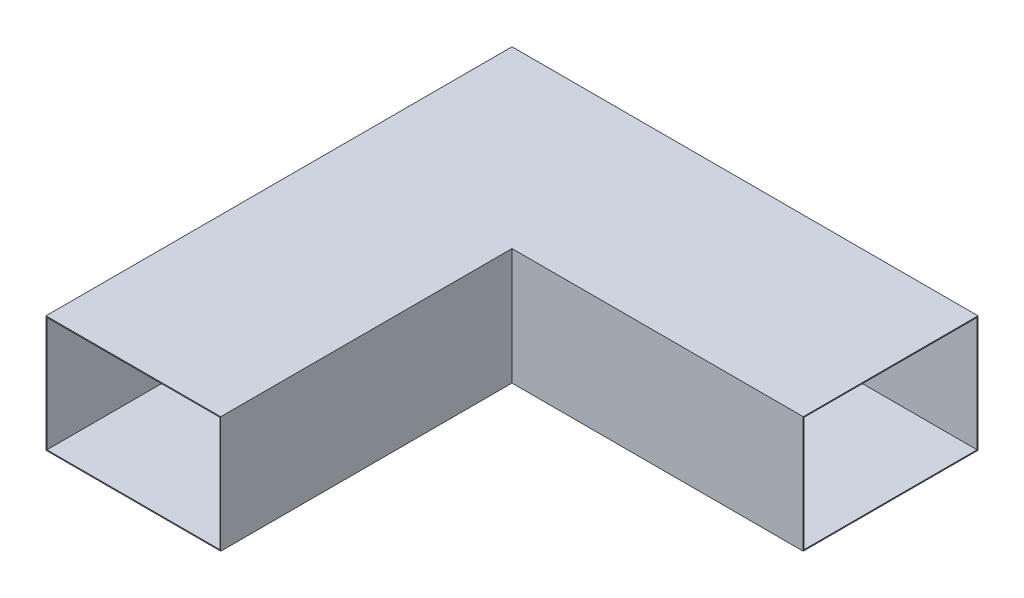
from build123d import *

# Parameters (mm, degrees)
SKETCH1_W           = 1219.2
SKETCH1_H           = 1219.2
BOSS_EXTRUDE1_DEPTH = 304.8
SKETCH2_W           = 762
SKETCH2_H           = 762
CUT_EXTRUDE1_DEPTH  = 304.8
SHELL1_T            = -2.54


with BuildPart() as part:
    # Sketch1 → Boss-Extrude1 (new body)
    with BuildSketch(Plane(origin=(0, 0, 0), x_dir=(1, 0, 0), z_dir=(0, 1, 0))):
        Rectangle(SKETCH1_W, SKETCH1_H)
    extrude(amount=BOSS_EXTRUDE1_DEPTH)

    # Sketch2 → Cut-Extrude1 (cut)
    with BuildSketch(Plane(origin=(0, 304.8, 0), x_dir=(1, 0, 0), z_dir=(0, 1, 0))):
        with Locations((228.6, -228.6)):
            Rectangle(SKETCH2_W, SKETCH2_H)
    extrude(amount=-CUT_EXTRUDE1_DEPTH, mode=Mode.SUBTRACT)

    # Shell1
    shell1_openings = [part.faces().sort_by_distance(p)[0] for p in [
        (609.6, 152.4, -381),
        (-381, 152.4, 609.6),
    ]]
    offset(amount=SHELL1_T, openings=shell1_openings, kind=Kind.INTERSECTION)


solid = part.part
